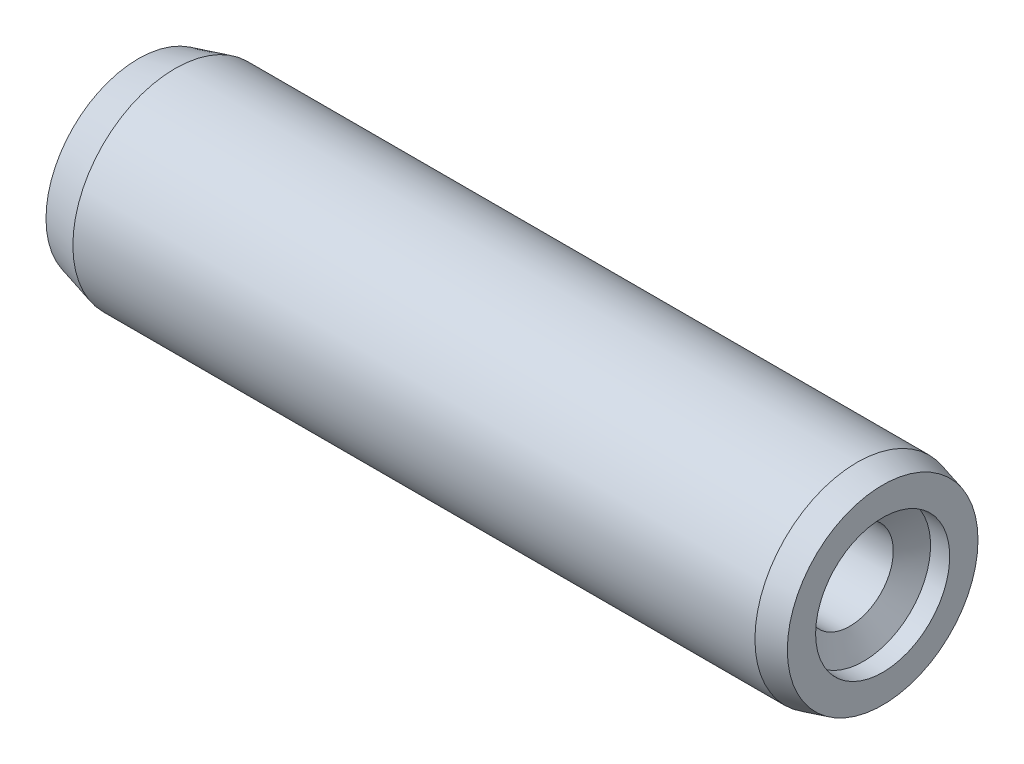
from build123d import *


with BuildPart() as part:
    # BodySke → Body (revolve)
    with BuildSketch(Plane.XY, mode=Mode.PRIVATE) as body_sk:
        with BuildLine():
            Line((4.6, 8), (58, 8))
            Line((58, 8), (60, 7.464101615))
            Line((60, 7.464101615), (60, 5.25))
            Line((60, 5.25), (58.5, 5.25))
            Line((58.5, 5.25), (57.431902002, 3.4))
            Line((57.431902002, 3.4), (35, 3.4))
            Line((35, 3.4), (33.591673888, 0))
            Line((33.591673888, 0), (0, 0))
            ThreePointArc((0, 0), (0.437676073, 3.716728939), (1.726759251, 7.230117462))
            Line((1.726759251, 7.230117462), (4.6, 8))
        make_face()
    revolve(body_sk.sketch.rotate(Axis((0, 0, 0), (1, 0, 0)), 90), axis=Axis((0, 0, 0), (1, 0, 0)))


solid = part.part
